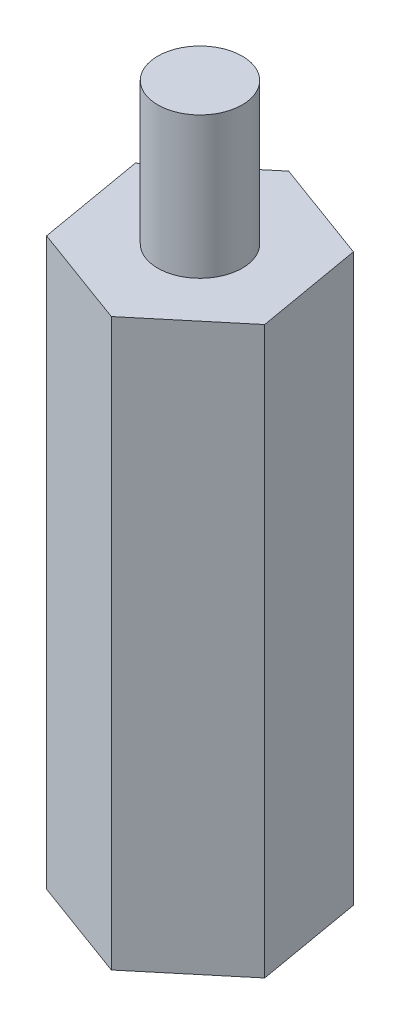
ISO-10303-21;
HEADER;
FILE_DESCRIPTION(('STEP AP214'),'2;1');
FILE_NAME('part.step','',(''),(''),'','','');
FILE_SCHEMA(('AUTOMOTIVE_DESIGN { 1 0 10303 214 1 1 1 1 }'));
ENDSEC;
DATA;
#1=APPLICATION_CONTEXT('core data for automotive mechanical design processes');
#2=APPLICATION_PROTOCOL_DEFINITION('international standard','automotive_design',2000,#1);
#3=PRODUCT_CONTEXT('',#1,'mechanical');
#4=PRODUCT('Part','Part','',(#3));
#5=PRODUCT_RELATED_PRODUCT_CATEGORY('part','',(#4));
#6=PRODUCT_DEFINITION_FORMATION('','',#4);
#7=PRODUCT_DEFINITION_CONTEXT('part definition',#1,'design');
#8=PRODUCT_DEFINITION('design','',#6,#7);
#9=PRODUCT_DEFINITION_SHAPE('','',#8);
#10=(LENGTH_UNIT() NAMED_UNIT(*) SI_UNIT(.MILLI.,.METRE.));
#11=(NAMED_UNIT(*) PLANE_ANGLE_UNIT() SI_UNIT($,.RADIAN.));
#12=(NAMED_UNIT(*) SI_UNIT($,.STERADIAN.) SOLID_ANGLE_UNIT());
#13=UNCERTAINTY_MEASURE_WITH_UNIT(LENGTH_MEASURE(1.E-05),#10,'distance_accuracy_value','');
#14=(GEOMETRIC_REPRESENTATION_CONTEXT(3) GLOBAL_UNCERTAINTY_ASSIGNED_CONTEXT((#13)) GLOBAL_UNIT_ASSIGNED_CONTEXT((#10,
#11,#12)) REPRESENTATION_CONTEXT('',''));
#15=CARTESIAN_POINT('',(0.,0.,0.));
#16=DIRECTION('',(0.,0.,1.));
#17=DIRECTION('',(1.,0.,0.));
#18=AXIS2_PLACEMENT_3D('',#15,#16,#17);
#19=CARTESIAN_POINT('',(6.25656263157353,19.05,-1.08532208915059));
#20=DIRECTION('',(0.,-1.,0.));
#21=DIRECTION('',(0.,0.,-1.));
#22=AXIS2_PLACEMENT_3D('',#19,#20,#21);
#23=PLANE('',#22);
#24=DIRECTION('',(-0.938740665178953,0.,-0.344624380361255));
#25=VECTOR('',#24,1.);
#26=CARTESIAN_POINT('',(2.81497581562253,19.05,-2.34877510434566));
#27=LINE('',#26,#25);
#28=CARTESIAN_POINT('',(2.81497581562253,19.05,-2.34877510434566));
#29=VERTEX_POINT('',#28);
#30=CARTESIAN_POINT('',(-0.6266110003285,19.05,-3.61222811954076));
#31=VERTEX_POINT('',#30);
#32=EDGE_CURVE('E123',#29,#31,#27,.T.);
#33=ORIENTED_EDGE('',*,*,#32,.T.);
#34=DIRECTION('',(-0.767823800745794,0.,0.640661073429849));
#35=VECTOR('',#34,1.);
#36=CARTESIAN_POINT('',(-0.6266110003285,19.05,-3.61222811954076));
#37=LINE('',#36,#35);
#38=CARTESIAN_POINT('',(-3.44158681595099,19.05,-1.2634530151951));
#39=VERTEX_POINT('',#38);
#40=EDGE_CURVE('E103',#31,#39,#37,.T.);
#41=ORIENTED_EDGE('',*,*,#40,.T.);
#42=DIRECTION('',(0.170916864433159,0.,0.985285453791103));
#43=VECTOR('',#42,1.);
#44=CARTESIAN_POINT('',(-3.44158681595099,19.05,-1.2634530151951));
#45=LINE('',#44,#43);
#46=CARTESIAN_POINT('',(-2.81497581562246,19.05,2.3487751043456));
#47=VERTEX_POINT('',#46);
#48=EDGE_CURVE('E126',#39,#47,#45,.T.);
#49=ORIENTED_EDGE('',*,*,#48,.T.);
#50=DIRECTION('',(0.938740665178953,0.,0.344624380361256));
#51=VECTOR('',#50,1.);
#52=CARTESIAN_POINT('',(-2.81497581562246,19.05,2.3487751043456));
#53=LINE('',#52,#51);
#54=CARTESIAN_POINT('',(0.626611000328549,19.05,3.6122281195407));
#55=VERTEX_POINT('',#54);
#56=EDGE_CURVE('E128',#47,#55,#53,.T.);
#57=ORIENTED_EDGE('',*,*,#56,.T.);
#58=DIRECTION('',(0.767823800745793,0.,-0.640661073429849));
#59=VECTOR('',#58,1.);
#60=CARTESIAN_POINT('',(0.626611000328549,19.05,3.6122281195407));
#61=LINE('',#60,#59);
#62=CARTESIAN_POINT('',(3.44158681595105,19.05,1.26345301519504));
#63=VERTEX_POINT('',#62);
#64=EDGE_CURVE('E56',#55,#63,#61,.T.);
#65=ORIENTED_EDGE('',*,*,#64,.T.);
#66=DIRECTION('',(-0.17091686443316,0.,-0.985285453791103));
#67=VECTOR('',#66,1.);
#68=CARTESIAN_POINT('',(3.44158681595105,19.05,1.26345301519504));
#69=LINE('',#68,#67);
#70=EDGE_CURVE('E51',#63,#29,#69,.T.);
#71=ORIENTED_EDGE('',*,*,#70,.T.);
#72=EDGE_LOOP('',(#33,#41,#49,#57,#65,#71));
#73=FACE_BOUND('',#72,.T.);
#74=CARTESIAN_POINT('',(0.,19.05,0.));
#75=DIRECTION('',(0.,-1.,0.));
#76=DIRECTION('',(0.,0.,-1.));
#77=AXIS2_PLACEMENT_3D('',#74,#75,#76);
#78=CIRCLE('',#77,1.4224);
#79=CARTESIAN_POINT('',(0.,19.05,-1.4224));
#80=VERTEX_POINT('',#79);
#81=EDGE_CURVE('E11',#80,#80,#78,.F.);
#82=ORIENTED_EDGE('',*,*,#81,.F.);
#83=EDGE_LOOP('',(#82));
#84=FACE_BOUND('',#83,.T.);
#85=ADVANCED_FACE('F36',(#73,#84),#23,.F.);
#86=CARTESIAN_POINT('',(2.81497581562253,19.05,-2.34877510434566));
#87=DIRECTION('',(-0.344624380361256,0.,0.938740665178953));
#88=DIRECTION('',(0.938740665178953,0.,0.344624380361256));
#89=AXIS2_PLACEMENT_3D('',#86,#87,#88);
#90=PLANE('',#89);
#91=DIRECTION('',(-0.938740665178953,0.,-0.344624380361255));
#92=VECTOR('',#91,1.);
#93=CARTESIAN_POINT('',(2.81497581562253,0.,-2.34877510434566));
#94=LINE('',#93,#92);
#95=CARTESIAN_POINT('',(2.81497581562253,0.,-2.34877510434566));
#96=VERTEX_POINT('',#95);
#97=CARTESIAN_POINT('',(-0.6266110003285,0.,-3.61222811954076));
#98=VERTEX_POINT('',#97);
#99=EDGE_CURVE('E94',#96,#98,#94,.T.);
#100=ORIENTED_EDGE('',*,*,#99,.T.);
#101=DIRECTION('',(0.,-1.,0.));
#102=VECTOR('',#101,1.);
#103=CARTESIAN_POINT('',(-0.6266110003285,19.05,-3.61222811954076));
#104=LINE('',#103,#102);
#105=EDGE_CURVE('E44',#31,#98,#104,.T.);
#106=ORIENTED_EDGE('',*,*,#105,.F.);
#107=ORIENTED_EDGE('',*,*,#32,.F.);
#108=DIRECTION('',(0.,-1.,0.));
#109=VECTOR('',#108,1.);
#110=CARTESIAN_POINT('',(2.81497581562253,19.05,-2.34877510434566));
#111=LINE('',#110,#109);
#112=EDGE_CURVE('E108',#29,#96,#111,.T.);
#113=ORIENTED_EDGE('',*,*,#112,.T.);
#114=EDGE_LOOP('',(#100,#106,#107,#113));
#115=FACE_BOUND('',#114,.T.);
#116=ADVANCED_FACE('F38',(#115),#90,.F.);
#117=CARTESIAN_POINT('',(-0.6266110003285,19.05,-3.61222811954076));
#118=DIRECTION('',(0.640661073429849,0.,0.767823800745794));
#119=DIRECTION('',(0.767823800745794,0.,-0.640661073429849));
#120=AXIS2_PLACEMENT_3D('',#117,#118,#119);
#121=PLANE('',#120);
#122=DIRECTION('',(-0.767823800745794,0.,0.640661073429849));
#123=VECTOR('',#122,1.);
#124=CARTESIAN_POINT('',(-0.6266110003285,0.,-3.61222811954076));
#125=LINE('',#124,#123);
#126=CARTESIAN_POINT('',(-3.44158681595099,0.,-1.2634530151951));
#127=VERTEX_POINT('',#126);
#128=EDGE_CURVE('E89',#98,#127,#125,.T.);
#129=ORIENTED_EDGE('',*,*,#128,.T.);
#130=DIRECTION('',(0.,-1.,0.));
#131=VECTOR('',#130,1.);
#132=CARTESIAN_POINT('',(-3.44158681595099,19.05,-1.2634530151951));
#133=LINE('',#132,#131);
#134=EDGE_CURVE('E106',#39,#127,#133,.T.);
#135=ORIENTED_EDGE('',*,*,#134,.F.);
#136=ORIENTED_EDGE('',*,*,#40,.F.);
#137=ORIENTED_EDGE('',*,*,#105,.T.);
#138=EDGE_LOOP('',(#129,#135,#136,#137));
#139=FACE_BOUND('',#138,.T.);
#140=ADVANCED_FACE('F102',(#139),#121,.F.);
#141=CARTESIAN_POINT('',(-3.44158681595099,19.05,-1.2634530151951));
#142=DIRECTION('',(0.985285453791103,0.,-0.170916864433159));
#143=DIRECTION('',(-0.170916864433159,0.,-0.985285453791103));
#144=AXIS2_PLACEMENT_3D('',#141,#142,#143);
#145=PLANE('',#144);
#146=DIRECTION('',(0.170916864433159,0.,0.985285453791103));
#147=VECTOR('',#146,1.);
#148=CARTESIAN_POINT('',(-3.44158681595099,0.,-1.2634530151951));
#149=LINE('',#148,#147);
#150=CARTESIAN_POINT('',(-2.81497581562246,0.,2.3487751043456));
#151=VERTEX_POINT('',#150);
#152=EDGE_CURVE('E96',#127,#151,#149,.T.);
#153=ORIENTED_EDGE('',*,*,#152,.T.);
#154=DIRECTION('',(0.,-1.,0.));
#155=VECTOR('',#154,1.);
#156=CARTESIAN_POINT('',(-2.81497581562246,19.05,2.3487751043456));
#157=LINE('',#156,#155);
#158=EDGE_CURVE('E139',#47,#151,#157,.T.);
#159=ORIENTED_EDGE('',*,*,#158,.F.);
#160=ORIENTED_EDGE('',*,*,#48,.F.);
#161=ORIENTED_EDGE('',*,*,#134,.T.);
#162=EDGE_LOOP('',(#153,#159,#160,#161));
#163=FACE_BOUND('',#162,.T.);
#164=ADVANCED_FACE('F144',(#163),#145,.F.);
#165=CARTESIAN_POINT('',(-2.81497581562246,19.05,2.3487751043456));
#166=DIRECTION('',(0.344624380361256,0.,-0.938740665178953));
#167=DIRECTION('',(-0.938740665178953,0.,-0.344624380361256));
#168=AXIS2_PLACEMENT_3D('',#165,#166,#167);
#169=PLANE('',#168);
#170=DIRECTION('',(0.938740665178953,0.,0.344624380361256));
#171=VECTOR('',#170,1.);
#172=CARTESIAN_POINT('',(-2.81497581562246,0.,2.3487751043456));
#173=LINE('',#172,#171);
#174=CARTESIAN_POINT('',(0.626611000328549,0.,3.6122281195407));
#175=VERTEX_POINT('',#174);
#176=EDGE_CURVE('E117',#151,#175,#173,.T.);
#177=ORIENTED_EDGE('',*,*,#176,.T.);
#178=DIRECTION('',(0.,-1.,0.));
#179=VECTOR('',#178,1.);
#180=CARTESIAN_POINT('',(0.626611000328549,19.05,3.6122281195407));
#181=LINE('',#180,#179);
#182=EDGE_CURVE('E136',#55,#175,#181,.T.);
#183=ORIENTED_EDGE('',*,*,#182,.F.);
#184=ORIENTED_EDGE('',*,*,#56,.F.);
#185=ORIENTED_EDGE('',*,*,#158,.T.);
#186=EDGE_LOOP('',(#177,#183,#184,#185));
#187=FACE_BOUND('',#186,.T.);
#188=ADVANCED_FACE('F150',(#187),#169,.F.);
#189=CARTESIAN_POINT('',(0.626611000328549,19.05,3.6122281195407));
#190=DIRECTION('',(-0.640661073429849,0.,-0.767823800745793));
#191=DIRECTION('',(-0.767823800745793,0.,0.640661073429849));
#192=AXIS2_PLACEMENT_3D('',#189,#190,#191);
#193=PLANE('',#192);
#194=DIRECTION('',(0.767823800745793,0.,-0.640661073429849));
#195=VECTOR('',#194,1.);
#196=CARTESIAN_POINT('',(0.626611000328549,0.,3.6122281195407));
#197=LINE('',#196,#195);
#198=CARTESIAN_POINT('',(3.44158681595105,0.,1.26345301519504));
#199=VERTEX_POINT('',#198);
#200=EDGE_CURVE('E119',#175,#199,#197,.T.);
#201=ORIENTED_EDGE('',*,*,#200,.T.);
#202=DIRECTION('',(0.,-1.,0.));
#203=VECTOR('',#202,1.);
#204=CARTESIAN_POINT('',(3.44158681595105,19.05,1.26345301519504));
#205=LINE('',#204,#203);
#206=EDGE_CURVE('E133',#63,#199,#205,.T.);
#207=ORIENTED_EDGE('',*,*,#206,.F.);
#208=ORIENTED_EDGE('',*,*,#64,.F.);
#209=ORIENTED_EDGE('',*,*,#182,.T.);
#210=EDGE_LOOP('',(#201,#207,#208,#209));
#211=FACE_BOUND('',#210,.T.);
#212=ADVANCED_FACE('F153',(#211),#193,.F.);
#213=CARTESIAN_POINT('',(3.44158681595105,19.05,1.26345301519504));
#214=DIRECTION('',(-0.985285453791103,0.,0.17091686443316));
#215=DIRECTION('',(0.17091686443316,0.,0.985285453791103));
#216=AXIS2_PLACEMENT_3D('',#213,#214,#215);
#217=PLANE('',#216);
#218=DIRECTION('',(-0.17091686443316,0.,-0.985285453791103));
#219=VECTOR('',#218,1.);
#220=CARTESIAN_POINT('',(3.44158681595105,0.,1.26345301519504));
#221=LINE('',#220,#219);
#222=EDGE_CURVE('E121',#199,#96,#221,.T.);
#223=ORIENTED_EDGE('',*,*,#222,.T.);
#224=ORIENTED_EDGE('',*,*,#112,.F.);
#225=ORIENTED_EDGE('',*,*,#70,.F.);
#226=ORIENTED_EDGE('',*,*,#206,.T.);
#227=EDGE_LOOP('',(#223,#224,#225,#226));
#228=FACE_BOUND('',#227,.T.);
#229=ADVANCED_FACE('F155',(#228),#217,.F.);
#230=CARTESIAN_POINT('',(6.25656263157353,0.,-1.08532208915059));
#231=DIRECTION('',(0.,-1.,0.));
#232=DIRECTION('',(0.,0.,-1.));
#233=AXIS2_PLACEMENT_3D('',#230,#231,#232);
#234=PLANE('',#233);
#235=CARTESIAN_POINT('',(0.,0.,0.));
#236=DIRECTION('',(0.,-1.,0.));
#237=DIRECTION('',(0.,0.,-1.));
#238=AXIS2_PLACEMENT_3D('',#235,#236,#237);
#239=CIRCLE('',#238,1.4224);
#240=CARTESIAN_POINT('',(0.,0.,-1.4224));
#241=VERTEX_POINT('',#240);
#242=EDGE_CURVE('E190',#241,#241,#239,.T.);
#243=ORIENTED_EDGE('',*,*,#242,.F.);
#244=EDGE_LOOP('',(#243));
#245=FACE_BOUND('',#244,.T.);
#246=ORIENTED_EDGE('',*,*,#99,.F.);
#247=ORIENTED_EDGE('',*,*,#222,.F.);
#248=ORIENTED_EDGE('',*,*,#200,.F.);
#249=ORIENTED_EDGE('',*,*,#176,.F.);
#250=ORIENTED_EDGE('',*,*,#152,.F.);
#251=ORIENTED_EDGE('',*,*,#128,.F.);
#252=EDGE_LOOP('',(#246,#247,#248,#249,#250,#251));
#253=FACE_BOUND('',#252,.T.);
#254=ADVANCED_FACE('F91',(#245,#253),#234,.T.);
#255=CARTESIAN_POINT('',(0.,23.8125,0.));
#256=DIRECTION('',(0.,-1.,0.));
#257=DIRECTION('',(0.,0.,-1.));
#258=AXIS2_PLACEMENT_3D('',#255,#256,#257);
#259=CYLINDRICAL_SURFACE('',#258,1.4224);
#260=CARTESIAN_POINT('',(0.,23.8125,0.));
#261=DIRECTION('',(0.,1.,0.));
#262=DIRECTION('',(0.,0.,1.));
#263=AXIS2_PLACEMENT_3D('',#260,#261,#262);
#264=CIRCLE('',#263,1.4224);
#265=CARTESIAN_POINT('',(0.,23.8125,-1.4224));
#266=VERTEX_POINT('',#265);
#267=EDGE_CURVE('E109',#266,#266,#264,.T.);
#268=CARTESIAN_POINT('',(0.,23.8125,-1.4224));
#269=CARTESIAN_POINT('',(0.,23.762890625,-1.4224));
#270=CARTESIAN_POINT('',(0.,23.71328125,-1.4224));
#271=CARTESIAN_POINT('',(0.,23.6140625,-1.4224));
#272=CARTESIAN_POINT('',(0.,23.564453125,-1.4224));
#273=CARTESIAN_POINT('',(0.,23.465234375,-1.4224));
#274=CARTESIAN_POINT('',(0.,23.415625,-1.4224));
#275=CARTESIAN_POINT('',(0.,23.31640625,-1.4224));
#276=CARTESIAN_POINT('',(0.,23.266796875,-1.4224));
#277=CARTESIAN_POINT('',(0.,23.167578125,-1.4224));
#278=CARTESIAN_POINT('',(0.,23.11796875,-1.4224));
#279=CARTESIAN_POINT('',(0.,23.01875,-1.4224));
#280=CARTESIAN_POINT('',(0.,22.969140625,-1.4224));
#281=CARTESIAN_POINT('',(0.,22.869921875,-1.4224));
#282=CARTESIAN_POINT('',(0.,22.8203125,-1.4224));
#283=CARTESIAN_POINT('',(0.,22.72109375,-1.4224));
#284=CARTESIAN_POINT('',(0.,22.671484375,-1.4224));
#285=CARTESIAN_POINT('',(0.,22.572265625,-1.4224));
#286=CARTESIAN_POINT('',(0.,22.52265625,-1.4224));
#287=CARTESIAN_POINT('',(0.,22.4234375,-1.4224));
#288=CARTESIAN_POINT('',(0.,22.373828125,-1.4224));
#289=CARTESIAN_POINT('',(0.,22.274609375,-1.4224));
#290=CARTESIAN_POINT('',(0.,22.225,-1.4224));
#291=CARTESIAN_POINT('',(0.,22.12578125,-1.4224));
#292=CARTESIAN_POINT('',(0.,22.076171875,-1.4224));
#293=CARTESIAN_POINT('',(0.,21.976953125,-1.4224));
#294=CARTESIAN_POINT('',(0.,21.92734375,-1.4224));
#295=CARTESIAN_POINT('',(0.,21.828125,-1.4224));
#296=CARTESIAN_POINT('',(0.,21.778515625,-1.4224));
#297=CARTESIAN_POINT('',(0.,21.679296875,-1.4224));
#298=CARTESIAN_POINT('',(0.,21.6296875,-1.4224));
#299=CARTESIAN_POINT('',(0.,21.53046875,-1.4224));
#300=CARTESIAN_POINT('',(0.,21.480859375,-1.4224));
#301=CARTESIAN_POINT('',(0.,21.381640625,-1.4224));
#302=CARTESIAN_POINT('',(0.,21.33203125,-1.4224));
#303=CARTESIAN_POINT('',(0.,21.2328125,-1.4224));
#304=CARTESIAN_POINT('',(0.,21.183203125,-1.4224));
#305=CARTESIAN_POINT('',(0.,21.083984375,-1.4224));
#306=CARTESIAN_POINT('',(0.,21.034375,-1.4224));
#307=CARTESIAN_POINT('',(0.,20.93515625,-1.4224));
#308=CARTESIAN_POINT('',(0.,20.885546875,-1.4224));
#309=CARTESIAN_POINT('',(0.,20.786328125,-1.4224));
#310=CARTESIAN_POINT('',(0.,20.73671875,-1.4224));
#311=CARTESIAN_POINT('',(0.,20.6375,-1.4224));
#312=CARTESIAN_POINT('',(0.,20.587890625,-1.4224));
#313=CARTESIAN_POINT('',(0.,20.488671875,-1.4224));
#314=CARTESIAN_POINT('',(0.,20.4390625,-1.4224));
#315=CARTESIAN_POINT('',(0.,20.33984375,-1.4224));
#316=CARTESIAN_POINT('',(0.,20.290234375,-1.4224));
#317=CARTESIAN_POINT('',(0.,20.191015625,-1.4224));
#318=CARTESIAN_POINT('',(0.,20.14140625,-1.4224));
#319=CARTESIAN_POINT('',(0.,20.0421875,-1.4224));
#320=CARTESIAN_POINT('',(0.,19.992578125,-1.4224));
#321=CARTESIAN_POINT('',(0.,19.893359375,-1.4224));
#322=CARTESIAN_POINT('',(0.,19.84375,-1.4224));
#323=CARTESIAN_POINT('',(0.,19.74453125,-1.4224));
#324=CARTESIAN_POINT('',(0.,19.694921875,-1.4224));
#325=CARTESIAN_POINT('',(0.,19.595703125,-1.4224));
#326=CARTESIAN_POINT('',(0.,19.54609375,-1.4224));
#327=CARTESIAN_POINT('',(0.,19.446875,-1.4224));
#328=CARTESIAN_POINT('',(0.,19.397265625,-1.4224));
#329=CARTESIAN_POINT('',(0.,19.298046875,-1.4224));
#330=CARTESIAN_POINT('',(0.,19.2484375,-1.4224));
#331=CARTESIAN_POINT('',(0.,19.14921875,-1.4224));
#332=CARTESIAN_POINT('',(0.,19.099609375,-1.4224));
#333=CARTESIAN_POINT('',(0.,19.05,-1.4224));
#334=B_SPLINE_CURVE_WITH_KNOTS('',3,(#268,#269,#270,#271,#272,#273,#274,#275,#276,#277,#278,
#279,#280,#281,#282,#283,#284,#285,#286,#287,#288,#289,#290,#291,#292,#293,#294,#295,#296,#297,
#298,#299,#300,#301,#302,#303,#304,#305,#306,#307,#308,#309,#310,#311,#312,#313,#314,#315,#316,
#317,#318,#319,#320,#321,#322,#323,#324,#325,#326,#327,#328,#329,#330,#331,#332,#333),
.UNSPECIFIED.,.F.,.F.,(4,2,2,2,2,2,2,2,2,2,2,2,2,2,2,2,2,2,2,2,2,2,2,2,2,2,2,2,2,2,2,2,4),(0.,
0.148828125,0.29765625,0.446484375,0.5953125,0.744140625,0.892968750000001,1.041796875,1.190625,
1.339453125,1.48828125,1.637109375,1.7859375,1.934765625,2.08359375,2.232421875,2.38125,
2.530078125,2.67890625,2.827734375,2.9765625,3.125390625,3.27421875,3.423046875,3.571875,
3.720703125,3.86953125,4.018359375,4.1671875,4.316015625,4.46484375,4.613671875,4.7625),.UNSPECIFIED.);
#335=EDGE_CURVE('BSEAM162',#266,#80,#334,.T.);
#336=ORIENTED_EDGE('',*,*,#267,.F.);
#337=ORIENTED_EDGE('',*,*,#81,.T.);
#338=ORIENTED_EDGE('',*,*,#335,.T.);
#339=ORIENTED_EDGE('',*,*,#335,.F.);
#340=EDGE_LOOP('',(#336,#338,#337,#339));
#341=FACE_BOUND('',#340,.T.);
#342=ADVANCED_FACE('F162',(#341),#259,.T.);
#343=CARTESIAN_POINT('',(0.,23.8125,0.));
#344=DIRECTION('',(0.,1.,0.));
#345=DIRECTION('',(0.,0.,1.));
#346=AXIS2_PLACEMENT_3D('',#343,#344,#345);
#347=PLANE('',#346);
#348=ORIENTED_EDGE('',*,*,#267,.T.);
#349=EDGE_LOOP('',(#348));
#350=FACE_BOUND('',#349,.T.);
#351=ADVANCED_FACE('F174',(#350),#347,.T.);
#352=CARTESIAN_POINT('',(0.,5.08,0.));
#353=DIRECTION('',(0.,-1.,0.));
#354=DIRECTION('',(0.,0.,-1.));
#355=AXIS2_PLACEMENT_3D('',#352,#353,#354);
#356=CYLINDRICAL_SURFACE('',#355,1.4224);
#357=CARTESIAN_POINT('',(0.,5.08,0.));
#358=DIRECTION('',(0.,-1.,0.));
#359=DIRECTION('',(0.,0.,-1.));
#360=AXIS2_PLACEMENT_3D('',#357,#358,#359);
#361=CIRCLE('',#360,1.4224);
#362=CARTESIAN_POINT('',(0.,5.08,-1.4224));
#363=VERTEX_POINT('',#362);
#364=EDGE_CURVE('E112',#363,#363,#361,.T.);
#365=ORIENTED_EDGE('',*,*,#364,.F.);
#366=EDGE_LOOP('',(#365));
#367=FACE_BOUND('',#366,.T.);
#368=ORIENTED_EDGE('',*,*,#242,.T.);
#369=EDGE_LOOP('',(#368));
#370=FACE_BOUND('',#369,.T.);
#371=ADVANCED_FACE('F178',(#367,#370),#356,.F.);
#372=CARTESIAN_POINT('',(0.,5.08,0.));
#373=DIRECTION('',(0.,-1.,0.));
#374=DIRECTION('',(0.,0.,-1.));
#375=AXIS2_PLACEMENT_3D('',#372,#373,#374);
#376=PLANE('',#375);
#377=ORIENTED_EDGE('',*,*,#364,.T.);
#378=EDGE_LOOP('',(#377));
#379=FACE_BOUND('',#378,.T.);
#380=ADVANCED_FACE('F182',(#379),#376,.T.);
#381=CLOSED_SHELL('',(#85,#116,#140,#164,#188,#212,#229,#254,#342,#351,#371,#380));
#382=MANIFOLD_SOLID_BREP('B2',#381);
#383=ADVANCED_BREP_SHAPE_REPRESENTATION('',(#18,#382),#14);
#384=SHAPE_DEFINITION_REPRESENTATION(#9,#383);
ENDSEC;
END-ISO-10303-21;
